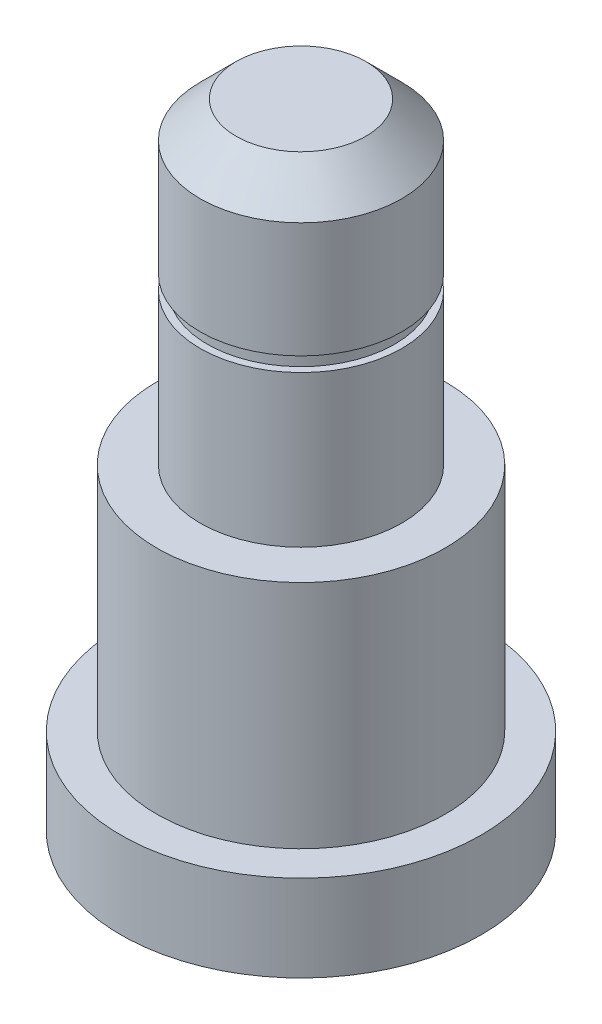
from build123d import *


with BuildPart() as part:
    # Esbo_o1 → Revolu_o1 (revolve)
    with BuildSketch(Plane.XY, mode=Mode.PRIVATE) as revolu_o1_sk:
        Polygon((0, 0), (12.5, 0), (12.5, 6), (10, 6), (10, 22), (7, 22), (7, 32.5), (6.5, 32.5), (6.5, 33.5), (7, 33.5), (7, 41.5), (4.5, 44), (0, 44), align=None)
    revolve(revolu_o1_sk.sketch.rotate(Axis((0, 44, 0), (0, -1, 0)), 180), axis=Axis((0, 44, 0), (0, -1, 0)))


solid = part.part
